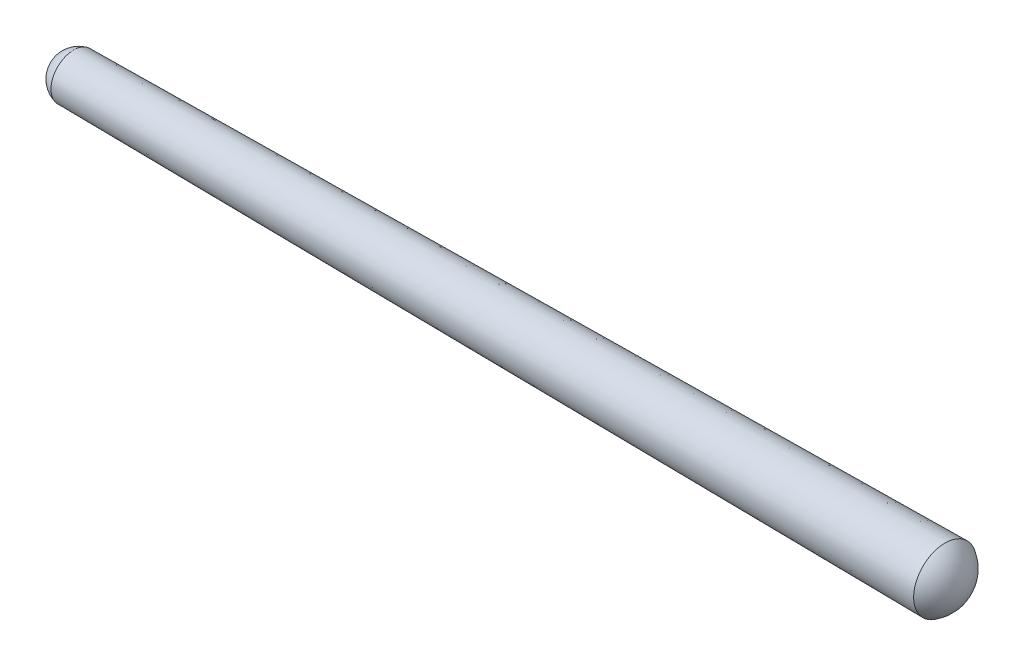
from build123d import *


with BuildPart() as part:
    # Sketch1 → Base-Revolve (revolve)
    with BuildSketch(Plane.XY):
        with BuildLine():
            Line((0.8, 1), (39.2, 1.384))
            ThreePointArc((39.2, 1.384), (39.785611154, 0.799289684), (40, 0))
            Line((40, 0), (0, 0))
            ThreePointArc((0, 0), (0.22460947, 0.640312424), (0.8, 1))
        make_face()
    revolve(axis=Axis((0, 0, 0), (1, 0, 0)))


solid = part.part
